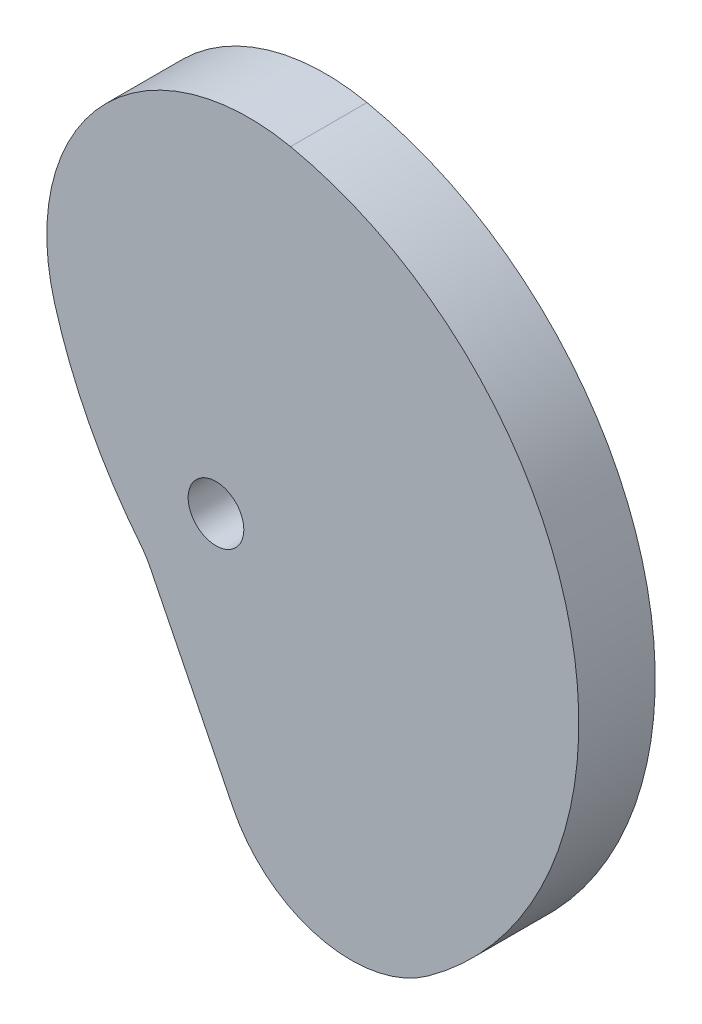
ISO-10303-21;
HEADER;
FILE_DESCRIPTION(('STEP AP214'),'2;1');
FILE_NAME('part.step','',(''),(''),'','','');
FILE_SCHEMA(('AUTOMOTIVE_DESIGN { 1 0 10303 214 1 1 1 1 }'));
ENDSEC;
DATA;
#1=APPLICATION_CONTEXT('core data for automotive mechanical design processes');
#2=APPLICATION_PROTOCOL_DEFINITION('international standard','automotive_design',2000,#1);
#3=PRODUCT_CONTEXT('',#1,'mechanical');
#4=PRODUCT('Part','Part','',(#3));
#5=PRODUCT_RELATED_PRODUCT_CATEGORY('part','',(#4));
#6=PRODUCT_DEFINITION_FORMATION('','',#4);
#7=PRODUCT_DEFINITION_CONTEXT('part definition',#1,'design');
#8=PRODUCT_DEFINITION('design','',#6,#7);
#9=PRODUCT_DEFINITION_SHAPE('','',#8);
#10=(LENGTH_UNIT() NAMED_UNIT(*) SI_UNIT(.MILLI.,.METRE.));
#11=(NAMED_UNIT(*) PLANE_ANGLE_UNIT() SI_UNIT($,.RADIAN.));
#12=(NAMED_UNIT(*) SI_UNIT($,.STERADIAN.) SOLID_ANGLE_UNIT());
#13=UNCERTAINTY_MEASURE_WITH_UNIT(LENGTH_MEASURE(1.E-05),#10,'distance_accuracy_value','');
#14=(GEOMETRIC_REPRESENTATION_CONTEXT(3) GLOBAL_UNCERTAINTY_ASSIGNED_CONTEXT((#13)) GLOBAL_UNIT_ASSIGNED_CONTEXT((#10,
#11,#12)) REPRESENTATION_CONTEXT('',''));
#15=CARTESIAN_POINT('',(0.,0.,0.));
#16=DIRECTION('',(0.,0.,1.));
#17=DIRECTION('',(1.,0.,0.));
#18=AXIS2_PLACEMENT_3D('',#15,#16,#17);
#19=CARTESIAN_POINT('',(0.,0.,20.));
#20=DIRECTION('',(0.,0.,1.));
#21=DIRECTION('',(1.,0.,0.));
#22=AXIS2_PLACEMENT_3D('',#19,#20,#21);
#23=PLANE('',#22);
#24=CARTESIAN_POINT('',(0.,0.,20.));
#25=DIRECTION('',(0.,0.,1.));
#26=DIRECTION('',(1.,0.,0.));
#27=AXIS2_PLACEMENT_3D('',#24,#25,#26);
#28=CIRCLE('',#27,94.9574737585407);
#29=CARTESIAN_POINT('',(55.5565293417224,-77.0090505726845,20.));
#30=VERTEX_POINT('',#29);
#31=CARTESIAN_POINT('',(19.5166954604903,92.9301911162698,20.));
#32=VERTEX_POINT('',#31);
#33=EDGE_CURVE('E434',#30,#32,#28,.T.);
#34=ORIENTED_EDGE('',*,*,#33,.T.);
#35=CARTESIAN_POINT('',(8.64,41.14,20.));
#36=DIRECTION('',(0.,0.,1.));
#37=DIRECTION('',(1.,0.,0.));
#38=AXIS2_PLACEMENT_3D('',#35,#36,#37);
#39=CIRCLE('',#38,52.92);
#40=CARTESIAN_POINT('',(-42.2269679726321,26.5428095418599,20.));
#41=VERTEX_POINT('',#40);
#42=EDGE_CURVE('E415',#32,#41,#39,.T.);
#43=ORIENTED_EDGE('',*,*,#42,.T.);
#44=CARTESIAN_POINT('',(77.01,60.76,20.));
#45=DIRECTION('',(0.,0.,1.));
#46=DIRECTION('',(1.,0.,0.));
#47=AXIS2_PLACEMENT_3D('',#44,#45,#46);
#48=CIRCLE('',#47,124.049468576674);
#49=CARTESIAN_POINT('',(-19.6619846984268,-16.9754361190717,20.));
#50=VERTEX_POINT('',#49);
#51=EDGE_CURVE('E437',#41,#50,#48,.T.);
#52=ORIENTED_EDGE('',*,*,#51,.T.);
#53=CARTESIAN_POINT('',(-35.25,-29.51,20.));
#54=DIRECTION('',(0.,0.,-1.));
#55=DIRECTION('',(1.,0.,0.));
#56=AXIS2_PLACEMENT_3D('',#53,#54,#55);
#57=CIRCLE('',#56,20.0025376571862);
#58=CARTESIAN_POINT('',(-17.3392615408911,-20.6045544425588,20.));
#59=VERTEX_POINT('',#58);
#60=EDGE_CURVE('E439',#50,#59,#57,.T.);
#61=ORIENTED_EDGE('',*,*,#60,.T.);
#62=DIRECTION('',(0.445215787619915,-0.895423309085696,0.));
#63=VECTOR('',#62,1.);
#64=CARTESIAN_POINT('',(-17.3392615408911,-20.6045544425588,20.));
#65=LINE('',#64,#63);
#66=CARTESIAN_POINT('',(4.42468255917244,-64.3764587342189,20.));
#67=VERTEX_POINT('',#66);
#68=EDGE_CURVE('E368',#59,#67,#65,.T.);
#69=ORIENTED_EDGE('',*,*,#68,.T.);
#70=CARTESIAN_POINT('',(35.35,-49.,20.));
#71=DIRECTION('',(0.,0.,1.));
#72=DIRECTION('',(1.,0.,0.));
#73=AXIS2_PLACEMENT_3D('',#70,#71,#72);
#74=CIRCLE('',#73,34.5370922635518);
#75=EDGE_CURVE('E363',#67,#30,#74,.T.);
#76=ORIENTED_EDGE('',*,*,#75,.T.);
#77=EDGE_LOOP('',(#34,#43,#52,#61,#69,#76));
#78=FACE_BOUND('',#77,.T.);
#79=CARTESIAN_POINT('',(0.,0.,20.));
#80=DIRECTION('',(0.,0.,1.));
#81=DIRECTION('',(1.,0.,0.));
#82=AXIS2_PLACEMENT_3D('',#79,#80,#81);
#83=CIRCLE('',#82,7.28597160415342);
#84=CARTESIAN_POINT('',(7.28597160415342,0.,20.));
#85=VERTEX_POINT('',#84);
#86=EDGE_CURVE('E420',#85,#85,#83,.T.);
#87=ORIENTED_EDGE('',*,*,#86,.F.);
#88=EDGE_LOOP('',(#87));
#89=FACE_BOUND('',#88,.T.);
#90=ADVANCED_FACE('F348',(#78,#89),#23,.T.);
#91=CARTESIAN_POINT('',(0.,0.,0.));
#92=DIRECTION('',(0.,0.,1.));
#93=DIRECTION('',(1.,0.,0.));
#94=AXIS2_PLACEMENT_3D('',#91,#92,#93);
#95=PLANE('',#94);
#96=CARTESIAN_POINT('',(0.,0.,0.));
#97=DIRECTION('',(0.,0.,1.));
#98=DIRECTION('',(1.,0.,0.));
#99=AXIS2_PLACEMENT_3D('',#96,#97,#98);
#100=CIRCLE('',#99,94.9574737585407);
#101=CARTESIAN_POINT('',(55.5565293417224,-77.0090505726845,0.));
#102=VERTEX_POINT('',#101);
#103=CARTESIAN_POINT('',(19.5166954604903,92.9301911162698,0.));
#104=VERTEX_POINT('',#103);
#105=EDGE_CURVE('E406',#102,#104,#100,.T.);
#106=ORIENTED_EDGE('',*,*,#105,.F.);
#107=CARTESIAN_POINT('',(35.35,-49.,0.));
#108=DIRECTION('',(0.,0.,1.));
#109=DIRECTION('',(1.,0.,0.));
#110=AXIS2_PLACEMENT_3D('',#107,#108,#109);
#111=CIRCLE('',#110,34.5370922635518);
#112=CARTESIAN_POINT('',(4.42468255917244,-64.3764587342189,0.));
#113=VERTEX_POINT('',#112);
#114=EDGE_CURVE('E432',#113,#102,#111,.T.);
#115=ORIENTED_EDGE('',*,*,#114,.F.);
#116=DIRECTION('',(0.445215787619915,-0.895423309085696,0.));
#117=VECTOR('',#116,1.);
#118=CARTESIAN_POINT('',(-17.3392615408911,-20.6045544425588,0.));
#119=LINE('',#118,#117);
#120=CARTESIAN_POINT('',(-17.3392615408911,-20.6045544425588,0.));
#121=VERTEX_POINT('',#120);
#122=EDGE_CURVE('E430',#121,#113,#119,.T.);
#123=ORIENTED_EDGE('',*,*,#122,.F.);
#124=CARTESIAN_POINT('',(-35.25,-29.51,0.));
#125=DIRECTION('',(0.,0.,-1.));
#126=DIRECTION('',(1.,0.,0.));
#127=AXIS2_PLACEMENT_3D('',#124,#125,#126);
#128=CIRCLE('',#127,20.0025376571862);
#129=CARTESIAN_POINT('',(-19.6619846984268,-16.9754361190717,0.));
#130=VERTEX_POINT('',#129);
#131=EDGE_CURVE('E428',#130,#121,#128,.T.);
#132=ORIENTED_EDGE('',*,*,#131,.F.);
#133=CARTESIAN_POINT('',(77.01,60.76,0.));
#134=DIRECTION('',(0.,0.,1.));
#135=DIRECTION('',(1.,0.,0.));
#136=AXIS2_PLACEMENT_3D('',#133,#134,#135);
#137=CIRCLE('',#136,124.049468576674);
#138=CARTESIAN_POINT('',(-42.2269679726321,26.5428095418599,0.));
#139=VERTEX_POINT('',#138);
#140=EDGE_CURVE('E408',#139,#130,#137,.T.);
#141=ORIENTED_EDGE('',*,*,#140,.F.);
#142=CARTESIAN_POINT('',(8.64,41.14,0.));
#143=DIRECTION('',(0.,0.,1.));
#144=DIRECTION('',(1.,0.,0.));
#145=AXIS2_PLACEMENT_3D('',#142,#143,#144);
#146=CIRCLE('',#145,52.92);
#147=EDGE_CURVE('E401',#104,#139,#146,.T.);
#148=ORIENTED_EDGE('',*,*,#147,.F.);
#149=EDGE_LOOP('',(#106,#115,#123,#132,#141,#148));
#150=FACE_BOUND('',#149,.T.);
#151=CARTESIAN_POINT('',(0.,0.,0.));
#152=DIRECTION('',(0.,0.,1.));
#153=DIRECTION('',(1.,0.,0.));
#154=AXIS2_PLACEMENT_3D('',#151,#152,#153);
#155=CIRCLE('',#154,7.28597160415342);
#156=CARTESIAN_POINT('',(7.28597160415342,0.,0.));
#157=VERTEX_POINT('',#156);
#158=EDGE_CURVE('E423',#157,#157,#155,.T.);
#159=ORIENTED_EDGE('',*,*,#158,.T.);
#160=EDGE_LOOP('',(#159));
#161=FACE_BOUND('',#160,.T.);
#162=ADVANCED_FACE('F402',(#150,#161),#95,.F.);
#163=CARTESIAN_POINT('',(0.,0.,20.));
#164=DIRECTION('',(0.,0.,-1.));
#165=DIRECTION('',(-1.,0.,0.));
#166=AXIS2_PLACEMENT_3D('',#163,#164,#165);
#167=CYLINDRICAL_SURFACE('',#166,94.9574737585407);
#168=ORIENTED_EDGE('',*,*,#105,.T.);
#169=DIRECTION('',(0.,0.,-1.));
#170=VECTOR('',#169,1.);
#171=CARTESIAN_POINT('',(19.5166954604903,92.9301911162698,20.));
#172=LINE('',#171,#170);
#173=EDGE_CURVE('E11',#32,#104,#172,.T.);
#174=ORIENTED_EDGE('',*,*,#173,.F.);
#175=ORIENTED_EDGE('',*,*,#33,.F.);
#176=DIRECTION('',(0.,0.,-1.));
#177=VECTOR('',#176,1.);
#178=CARTESIAN_POINT('',(55.5565293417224,-77.0090505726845,20.));
#179=LINE('',#178,#177);
#180=EDGE_CURVE('E419',#30,#102,#179,.T.);
#181=ORIENTED_EDGE('',*,*,#180,.T.);
#182=EDGE_LOOP('',(#168,#174,#175,#181));
#183=FACE_BOUND('',#182,.T.);
#184=ADVANCED_FACE('F350',(#183),#167,.T.);
#185=CARTESIAN_POINT('',(8.64,41.14,20.));
#186=DIRECTION('',(0.,0.,-1.));
#187=DIRECTION('',(-1.,0.,0.));
#188=AXIS2_PLACEMENT_3D('',#185,#186,#187);
#189=CYLINDRICAL_SURFACE('',#188,52.92);
#190=ORIENTED_EDGE('',*,*,#147,.T.);
#191=DIRECTION('',(0.,0.,-1.));
#192=VECTOR('',#191,1.);
#193=CARTESIAN_POINT('',(-42.2269679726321,26.5428095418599,20.));
#194=LINE('',#193,#192);
#195=EDGE_CURVE('E356',#41,#139,#194,.T.);
#196=ORIENTED_EDGE('',*,*,#195,.F.);
#197=ORIENTED_EDGE('',*,*,#42,.F.);
#198=ORIENTED_EDGE('',*,*,#173,.T.);
#199=EDGE_LOOP('',(#190,#196,#197,#198));
#200=FACE_BOUND('',#199,.T.);
#201=ADVANCED_FACE('F414',(#200),#189,.T.);
#202=CARTESIAN_POINT('',(77.01,60.76,20.));
#203=DIRECTION('',(0.,0.,-1.));
#204=DIRECTION('',(-1.,0.,0.));
#205=AXIS2_PLACEMENT_3D('',#202,#203,#204);
#206=CYLINDRICAL_SURFACE('',#205,124.049468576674);
#207=ORIENTED_EDGE('',*,*,#140,.T.);
#208=DIRECTION('',(0.,0.,-1.));
#209=VECTOR('',#208,1.);
#210=CARTESIAN_POINT('',(-19.6619846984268,-16.9754361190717,20.));
#211=LINE('',#210,#209);
#212=EDGE_CURVE('E450',#50,#130,#211,.T.);
#213=ORIENTED_EDGE('',*,*,#212,.F.);
#214=ORIENTED_EDGE('',*,*,#51,.F.);
#215=ORIENTED_EDGE('',*,*,#195,.T.);
#216=EDGE_LOOP('',(#207,#213,#214,#215));
#217=FACE_BOUND('',#216,.T.);
#218=ADVANCED_FACE('F454',(#217),#206,.T.);
#219=CARTESIAN_POINT('',(-35.25,-29.51,20.));
#220=DIRECTION('',(0.,0.,-1.));
#221=DIRECTION('',(-1.,0.,0.));
#222=AXIS2_PLACEMENT_3D('',#219,#220,#221);
#223=CYLINDRICAL_SURFACE('',#222,20.0025376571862);
#224=ORIENTED_EDGE('',*,*,#131,.T.);
#225=DIRECTION('',(0.,0.,-1.));
#226=VECTOR('',#225,1.);
#227=CARTESIAN_POINT('',(-17.3392615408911,-20.6045544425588,20.));
#228=LINE('',#227,#226);
#229=EDGE_CURVE('E447',#59,#121,#228,.T.);
#230=ORIENTED_EDGE('',*,*,#229,.F.);
#231=ORIENTED_EDGE('',*,*,#60,.F.);
#232=ORIENTED_EDGE('',*,*,#212,.T.);
#233=EDGE_LOOP('',(#224,#230,#231,#232));
#234=FACE_BOUND('',#233,.T.);
#235=ADVANCED_FACE('F460',(#234),#223,.F.);
#236=CARTESIAN_POINT('',(-17.3392615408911,-20.6045544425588,20.));
#237=DIRECTION('',(0.895423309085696,0.445215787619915,0.));
#238=DIRECTION('',(-0.445215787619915,0.895423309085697,0.));
#239=AXIS2_PLACEMENT_3D('',#236,#237,#238);
#240=PLANE('',#239);
#241=ORIENTED_EDGE('',*,*,#122,.T.);
#242=DIRECTION('',(0.,0.,-1.));
#243=VECTOR('',#242,1.);
#244=CARTESIAN_POINT('',(4.42468255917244,-64.3764587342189,20.));
#245=LINE('',#244,#243);
#246=EDGE_CURVE('E444',#67,#113,#245,.T.);
#247=ORIENTED_EDGE('',*,*,#246,.F.);
#248=ORIENTED_EDGE('',*,*,#68,.F.);
#249=ORIENTED_EDGE('',*,*,#229,.T.);
#250=EDGE_LOOP('',(#241,#247,#248,#249));
#251=FACE_BOUND('',#250,.T.);
#252=ADVANCED_FACE('F463',(#251),#240,.F.);
#253=CARTESIAN_POINT('',(35.35,-49.,20.));
#254=DIRECTION('',(0.,0.,-1.));
#255=DIRECTION('',(-1.,0.,0.));
#256=AXIS2_PLACEMENT_3D('',#253,#254,#255);
#257=CYLINDRICAL_SURFACE('',#256,34.5370922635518);
#258=ORIENTED_EDGE('',*,*,#114,.T.);
#259=ORIENTED_EDGE('',*,*,#180,.F.);
#260=ORIENTED_EDGE('',*,*,#75,.F.);
#261=ORIENTED_EDGE('',*,*,#246,.T.);
#262=EDGE_LOOP('',(#258,#259,#260,#261));
#263=FACE_BOUND('',#262,.T.);
#264=ADVANCED_FACE('F465',(#263),#257,.T.);
#265=CARTESIAN_POINT('',(0.,0.,20.));
#266=DIRECTION('',(0.,0.,-1.));
#267=DIRECTION('',(-1.,0.,0.));
#268=AXIS2_PLACEMENT_3D('',#265,#266,#267);
#269=CYLINDRICAL_SURFACE('',#268,7.28597160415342);
#270=ORIENTED_EDGE('',*,*,#86,.T.);
#271=EDGE_LOOP('',(#270));
#272=FACE_BOUND('',#271,.T.);
#273=ORIENTED_EDGE('',*,*,#158,.F.);
#274=EDGE_LOOP('',(#273));
#275=FACE_BOUND('',#274,.T.);
#276=ADVANCED_FACE('F467',(#272,#275),#269,.F.);
#277=CLOSED_SHELL('',(#90,#162,#184,#201,#218,#235,#252,#264,#276));
#278=MANIFOLD_SOLID_BREP('B2',#277);
#279=ADVANCED_BREP_SHAPE_REPRESENTATION('',(#18,#278),#14);
#280=SHAPE_DEFINITION_REPRESENTATION(#9,#279);
ENDSEC;
END-ISO-10303-21;
